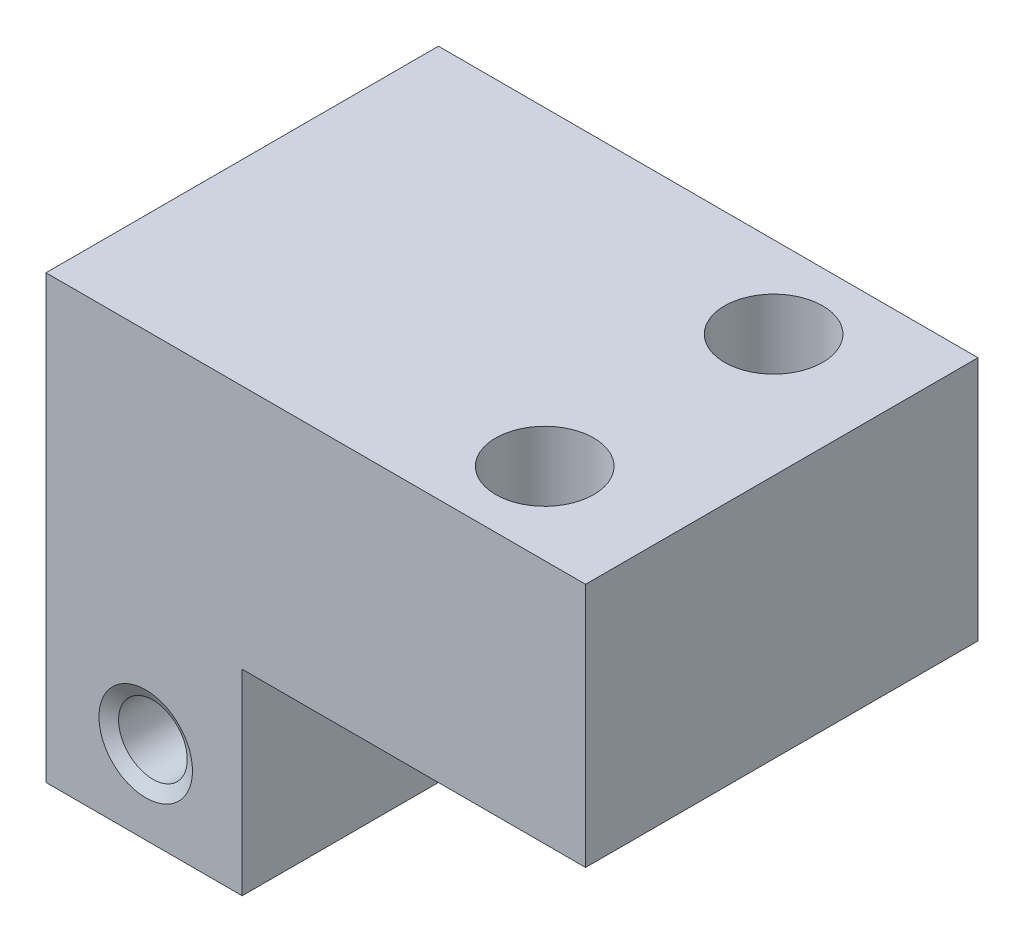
ISO-10303-21;
HEADER;
FILE_DESCRIPTION(('STEP AP214'),'2;1');
FILE_NAME('part.step','',(''),(''),'','','');
FILE_SCHEMA(('AUTOMOTIVE_DESIGN { 1 0 10303 214 1 1 1 1 }'));
ENDSEC;
DATA;
#1=APPLICATION_CONTEXT('core data for automotive mechanical design processes');
#2=APPLICATION_PROTOCOL_DEFINITION('international standard','automotive_design',2000,#1);
#3=PRODUCT_CONTEXT('',#1,'mechanical');
#4=PRODUCT('Part','Part','',(#3));
#5=PRODUCT_RELATED_PRODUCT_CATEGORY('part','',(#4));
#6=PRODUCT_DEFINITION_FORMATION('','',#4);
#7=PRODUCT_DEFINITION_CONTEXT('part definition',#1,'design');
#8=PRODUCT_DEFINITION('design','',#6,#7);
#9=PRODUCT_DEFINITION_SHAPE('','',#8);
#10=(LENGTH_UNIT() NAMED_UNIT(*) SI_UNIT(.MILLI.,.METRE.));
#11=(NAMED_UNIT(*) PLANE_ANGLE_UNIT() SI_UNIT($,.RADIAN.));
#12=(NAMED_UNIT(*) SI_UNIT($,.STERADIAN.) SOLID_ANGLE_UNIT());
#13=UNCERTAINTY_MEASURE_WITH_UNIT(LENGTH_MEASURE(1.E-05),#10,'distance_accuracy_value','');
#14=(GEOMETRIC_REPRESENTATION_CONTEXT(3) GLOBAL_UNCERTAINTY_ASSIGNED_CONTEXT((#13)) GLOBAL_UNIT_ASSIGNED_CONTEXT((#10,
#11,#12)) REPRESENTATION_CONTEXT('',''));
#15=CARTESIAN_POINT('',(0.,0.,0.));
#16=DIRECTION('',(0.,0.,1.));
#17=DIRECTION('',(1.,0.,0.));
#18=AXIS2_PLACEMENT_3D('',#15,#16,#17);
#19=CARTESIAN_POINT('',(-13.9,-6.9,-19.800000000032));
#20=DIRECTION('',(0.,0.,1.));
#21=DIRECTION('',(1.,0.,0.));
#22=AXIS2_PLACEMENT_3D('',#19,#20,#21);
#23=CONICAL_SURFACE('',#22,2.0999999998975,1.02974425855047);
#24=CARTESIAN_POINT('',(-13.9,-6.90000000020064,-21.0618072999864));
#25=VERTEX_POINT('',#24);
#26=VERTEX_LOOP('',#25);
#27=FACE_BOUND('',#26,.T.);
#28=CARTESIAN_POINT('',(-13.9,-6.9,-19.8));
#29=DIRECTION('',(0.,0.,1.));
#30=DIRECTION('',(0.,-1.,0.));
#31=AXIS2_PLACEMENT_3D('',#28,#29,#30);
#32=CIRCLE('',#31,2.1);
#33=CARTESIAN_POINT('',(-13.9,-9.,-19.8));
#34=VERTEX_POINT('',#33);
#35=EDGE_CURVE('E78',#34,#34,#32,.T.);
#36=ORIENTED_EDGE('',*,*,#35,.T.);
#37=EDGE_LOOP('',(#36));
#38=FACE_BOUND('',#37,.T.);
#39=ADVANCED_FACE('F16',(#27,#38),#23,.F.);
#40=CARTESIAN_POINT('',(-13.9,-6.9,-5.));
#41=DIRECTION('',(0.,0.,1.));
#42=DIRECTION('',(0.,-1.,0.));
#43=AXIS2_PLACEMENT_3D('',#40,#41,#42);
#44=CYLINDRICAL_SURFACE('',#43,2.1);
#45=ORIENTED_EDGE('',*,*,#35,.F.);
#46=EDGE_LOOP('',(#45));
#47=FACE_BOUND('',#46,.T.);
#48=CARTESIAN_POINT('',(-13.9,-6.9,-5.43878620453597));
#49=DIRECTION('',(0.,0.,1.));
#50=DIRECTION('',(1.,0.,0.));
#51=AXIS2_PLACEMENT_3D('',#48,#49,#50);
#52=CIRCLE('',#51,2.10000000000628);
#53=CARTESIAN_POINT('',(-11.7999999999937,-6.9,-5.43878620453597));
#54=VERTEX_POINT('',#53);
#55=EDGE_CURVE('E80',#54,#54,#52,.T.);
#56=ORIENTED_EDGE('',*,*,#55,.T.);
#57=EDGE_LOOP('',(#56));
#58=FACE_BOUND('',#57,.T.);
#59=ADVANCED_FACE('F75',(#47,#58),#44,.F.);
#60=CARTESIAN_POINT('',(-13.9,-6.9,-4.99999999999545));
#61=DIRECTION('',(0.,0.,1.));
#62=DIRECTION('',(1.,0.,0.));
#63=AXIS2_PLACEMENT_3D('',#60,#61,#62);
#64=CONICAL_SURFACE('',#63,2.85999999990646,1.0471975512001);
#65=CARTESIAN_POINT('',(-13.9,-6.9,-4.99999999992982));
#66=DIRECTION('',(0.,0.,1.));
#67=DIRECTION('',(1.,0.,0.));
#68=AXIS2_PLACEMENT_3D('',#65,#66,#67);
#69=CIRCLE('',#68,2.86000000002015);
#70=CARTESIAN_POINT('',(-11.0399999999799,-6.9,-4.99999999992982));
#71=VERTEX_POINT('',#70);
#72=EDGE_CURVE('E95',#71,#71,#69,.T.);
#73=ORIENTED_EDGE('',*,*,#72,.T.);
#74=EDGE_LOOP('',(#73));
#75=FACE_BOUND('',#74,.T.);
#76=ORIENTED_EDGE('',*,*,#55,.F.);
#77=EDGE_LOOP('',(#76));
#78=FACE_BOUND('',#77,.T.);
#79=ADVANCED_FACE('F192',(#75,#78),#64,.F.);
#80=CARTESIAN_POINT('',(13.,-12.,-35.));
#81=DIRECTION('',(0.,1.,0.));
#82=DIRECTION('',(0.,0.,1.));
#83=AXIS2_PLACEMENT_3D('',#80,#81,#82);
#84=PLANE('',#83);
#85=DIRECTION('',(1.,0.,0.));
#86=VECTOR('',#85,1.);
#87=CARTESIAN_POINT('',(13.,-12.,-5.));
#88=LINE('',#87,#86);
#89=CARTESIAN_POINT('',(-8.,-12.,-5.));
#90=VERTEX_POINT('',#89);
#91=CARTESIAN_POINT('',(-20.,-12.,-5.));
#92=VERTEX_POINT('',#91);
#93=EDGE_CURVE('E119',#90,#92,#88,.F.);
#94=ORIENTED_EDGE('',*,*,#93,.T.);
#95=DIRECTION('',(0.,0.,1.));
#96=VECTOR('',#95,1.);
#97=CARTESIAN_POINT('',(-20.,-12.,0.));
#98=LINE('',#97,#96);
#99=CARTESIAN_POINT('',(-20.,-12.,-28.9999999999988));
#100=VERTEX_POINT('',#99);
#101=EDGE_CURVE('E122',#100,#92,#98,.T.);
#102=ORIENTED_EDGE('',*,*,#101,.F.);
#103=DIRECTION('',(1.,0.,0.));
#104=VECTOR('',#103,1.);
#105=CARTESIAN_POINT('',(13.,-12.,-28.9999999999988));
#106=LINE('',#105,#104);
#107=CARTESIAN_POINT('',(-8.,-12.,-28.9999999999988));
#108=VERTEX_POINT('',#107);
#109=EDGE_CURVE('E127',#100,#108,#106,.T.);
#110=ORIENTED_EDGE('',*,*,#109,.T.);
#111=DIRECTION('',(0.,0.,1.));
#112=VECTOR('',#111,1.);
#113=CARTESIAN_POINT('',(-8.,-12.,-2.59759999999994));
#114=LINE('',#113,#112);
#115=EDGE_CURVE('E83',#108,#90,#114,.T.);
#116=ORIENTED_EDGE('',*,*,#115,.T.);
#117=EDGE_LOOP('',(#94,#102,#110,#116));
#118=FACE_BOUND('',#117,.T.);
#119=ADVANCED_FACE('F189',(#118),#84,.F.);
#120=CARTESIAN_POINT('',(-8.,0.,-2.59759999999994));
#121=DIRECTION('',(-1.,0.,0.));
#122=DIRECTION('',(0.,-1.,0.));
#123=AXIS2_PLACEMENT_3D('',#120,#121,#122);
#124=PLANE('',#123);
#125=DIRECTION('',(0.,1.,0.));
#126=VECTOR('',#125,1.);
#127=CARTESIAN_POINT('',(-8.,15.,-28.9999999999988));
#128=LINE('',#127,#126);
#129=CARTESIAN_POINT('',(-8.,0.,-28.9999999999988));
#130=VERTEX_POINT('',#129);
#131=EDGE_CURVE('E130',#108,#130,#128,.T.);
#132=ORIENTED_EDGE('',*,*,#131,.T.);
#133=DIRECTION('',(0.,0.,1.));
#134=VECTOR('',#133,1.);
#135=CARTESIAN_POINT('',(-8.,0.,-2.5976));
#136=LINE('',#135,#134);
#137=CARTESIAN_POINT('',(-8.,0.,-5.));
#138=VERTEX_POINT('',#137);
#139=EDGE_CURVE('E104',#130,#138,#136,.T.);
#140=ORIENTED_EDGE('',*,*,#139,.T.);
#141=DIRECTION('',(0.,1.,0.));
#142=VECTOR('',#141,1.);
#143=CARTESIAN_POINT('',(-8.,15.,-5.));
#144=LINE('',#143,#142);
#145=EDGE_CURVE('E117',#138,#90,#144,.F.);
#146=ORIENTED_EDGE('',*,*,#145,.T.);
#147=ORIENTED_EDGE('',*,*,#115,.F.);
#148=EDGE_LOOP('',(#132,#140,#146,#147));
#149=FACE_BOUND('',#148,.T.);
#150=ADVANCED_FACE('F186',(#149),#124,.F.);
#151=CARTESIAN_POINT('',(17.,0.,-2.5976));
#152=DIRECTION('',(0.,1.,0.));
#153=DIRECTION('',(-1.,0.,0.));
#154=AXIS2_PLACEMENT_3D('',#151,#152,#153);
#155=PLANE('',#154);
#156=DIRECTION('',(1.,0.,0.));
#157=VECTOR('',#156,1.);
#158=CARTESIAN_POINT('',(13.,0.,-5.));
#159=LINE('',#158,#157);
#160=CARTESIAN_POINT('',(13.,0.,-5.));
#161=VERTEX_POINT('',#160);
#162=EDGE_CURVE('E115',#161,#138,#159,.F.);
#163=ORIENTED_EDGE('',*,*,#162,.T.);
#164=ORIENTED_EDGE('',*,*,#139,.F.);
#165=DIRECTION('',(1.,0.,0.));
#166=VECTOR('',#165,1.);
#167=CARTESIAN_POINT('',(13.,0.,-28.9999999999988));
#168=LINE('',#167,#166);
#169=CARTESIAN_POINT('',(13.,0.,-28.9999999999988));
#170=VERTEX_POINT('',#169);
#171=EDGE_CURVE('E132',#130,#170,#168,.T.);
#172=ORIENTED_EDGE('',*,*,#171,.T.);
#173=DIRECTION('',(0.,0.,1.));
#174=VECTOR('',#173,1.);
#175=CARTESIAN_POINT('',(13.,0.,0.));
#176=LINE('',#175,#174);
#177=EDGE_CURVE('E69',#170,#161,#176,.T.);
#178=ORIENTED_EDGE('',*,*,#177,.T.);
#179=EDGE_LOOP('',(#163,#164,#172,#178));
#180=FACE_BOUND('',#179,.T.);
#181=CARTESIAN_POINT('',(5.50000000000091,0.,-23.9999999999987));
#182=DIRECTION('',(0.,-1.,0.));
#183=DIRECTION('',(1.,0.,0.));
#184=AXIS2_PLACEMENT_3D('',#181,#182,#183);
#185=CIRCLE('',#184,3.);
#186=CARTESIAN_POINT('',(8.50000000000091,0.,-23.9999999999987));
#187=VERTEX_POINT('',#186);
#188=EDGE_CURVE('E98',#187,#187,#185,.F.);
#189=ORIENTED_EDGE('',*,*,#188,.T.);
#190=EDGE_LOOP('',(#189));
#191=FACE_BOUND('',#190,.T.);
#192=CARTESIAN_POINT('',(5.50000000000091,0.,-10.));
#193=DIRECTION('',(0.,-1.,0.));
#194=DIRECTION('',(1.,0.,0.));
#195=AXIS2_PLACEMENT_3D('',#192,#193,#194);
#196=CIRCLE('',#195,3.);
#197=CARTESIAN_POINT('',(8.50000000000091,0.,-10.));
#198=VERTEX_POINT('',#197);
#199=EDGE_CURVE('E19',#198,#198,#196,.F.);
#200=ORIENTED_EDGE('',*,*,#199,.T.);
#201=EDGE_LOOP('',(#200));
#202=FACE_BOUND('',#201,.T.);
#203=ADVANCED_FACE('F182',(#180,#191,#202),#155,.F.);
#204=CARTESIAN_POINT('',(5.50000000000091,0.,-10.));
#205=DIRECTION('',(0.,-1.,0.));
#206=DIRECTION('',(1.,0.,0.));
#207=AXIS2_PLACEMENT_3D('',#204,#205,#206);
#208=CYLINDRICAL_SURFACE('',#207,3.);
#209=CARTESIAN_POINT('',(5.5000000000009,15.,-10.));
#210=DIRECTION('',(0.,-1.,0.));
#211=DIRECTION('',(1.,0.,0.));
#212=AXIS2_PLACEMENT_3D('',#209,#210,#211);
#213=CIRCLE('',#212,3.);
#214=CARTESIAN_POINT('',(8.5000000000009,15.,-10.));
#215=VERTEX_POINT('',#214);
#216=EDGE_CURVE('E91',#215,#215,#213,.F.);
#217=ORIENTED_EDGE('',*,*,#216,.T.);
#218=EDGE_LOOP('',(#217));
#219=FACE_BOUND('',#218,.T.);
#220=ORIENTED_EDGE('',*,*,#199,.F.);
#221=EDGE_LOOP('',(#220));
#222=FACE_BOUND('',#221,.T.);
#223=ADVANCED_FACE('F178',(#219,#222),#208,.F.);
#224=CARTESIAN_POINT('',(5.50000000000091,0.,-23.9999999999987));
#225=DIRECTION('',(0.,-1.,0.));
#226=DIRECTION('',(1.,0.,0.));
#227=AXIS2_PLACEMENT_3D('',#224,#225,#226);
#228=CYLINDRICAL_SURFACE('',#227,3.);
#229=CARTESIAN_POINT('',(5.5000000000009,15.,-23.9999999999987));
#230=DIRECTION('',(0.,-1.,0.));
#231=DIRECTION('',(1.,0.,0.));
#232=AXIS2_PLACEMENT_3D('',#229,#230,#231);
#233=CIRCLE('',#232,3.);
#234=CARTESIAN_POINT('',(8.5000000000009,15.,-23.9999999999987));
#235=VERTEX_POINT('',#234);
#236=EDGE_CURVE('E87',#235,#235,#233,.F.);
#237=ORIENTED_EDGE('',*,*,#236,.T.);
#238=EDGE_LOOP('',(#237));
#239=FACE_BOUND('',#238,.T.);
#240=ORIENTED_EDGE('',*,*,#188,.F.);
#241=EDGE_LOOP('',(#240));
#242=FACE_BOUND('',#241,.T.);
#243=ADVANCED_FACE('F175',(#239,#242),#228,.F.);
#244=CARTESIAN_POINT('',(13.,0.,0.));
#245=DIRECTION('',(-1.,0.,0.));
#246=DIRECTION('',(0.,0.,1.));
#247=AXIS2_PLACEMENT_3D('',#244,#245,#246);
#248=PLANE('',#247);
#249=ORIENTED_EDGE('',*,*,#177,.F.);
#250=DIRECTION('',(0.,1.,0.));
#251=VECTOR('',#250,1.);
#252=CARTESIAN_POINT('',(13.,15.,-28.9999999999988));
#253=LINE('',#252,#251);
#254=CARTESIAN_POINT('',(13.,15.,-28.9999999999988));
#255=VERTEX_POINT('',#254);
#256=EDGE_CURVE('E94',#170,#255,#253,.T.);
#257=ORIENTED_EDGE('',*,*,#256,.T.);
#258=DIRECTION('',(0.,0.,-1.));
#259=VECTOR('',#258,1.);
#260=CARTESIAN_POINT('',(13.,15.,-10.4999999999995));
#261=LINE('',#260,#259);
#262=CARTESIAN_POINT('',(13.,15.,-5.));
#263=VERTEX_POINT('',#262);
#264=EDGE_CURVE('E90',#255,#263,#261,.F.);
#265=ORIENTED_EDGE('',*,*,#264,.T.);
#266=DIRECTION('',(0.,1.,0.));
#267=VECTOR('',#266,1.);
#268=CARTESIAN_POINT('',(13.,15.,-5.));
#269=LINE('',#268,#267);
#270=EDGE_CURVE('E97',#263,#161,#269,.F.);
#271=ORIENTED_EDGE('',*,*,#270,.T.);
#272=EDGE_LOOP('',(#249,#257,#265,#271));
#273=FACE_BOUND('',#272,.T.);
#274=ADVANCED_FACE('F155',(#273),#248,.F.);
#275=CARTESIAN_POINT('',(13.,15.,-5.));
#276=DIRECTION('',(0.,0.,-1.));
#277=DIRECTION('',(0.,1.,0.));
#278=AXIS2_PLACEMENT_3D('',#275,#276,#277);
#279=PLANE('',#278);
#280=DIRECTION('',(0.,1.,0.));
#281=VECTOR('',#280,1.);
#282=CARTESIAN_POINT('',(-20.,0.,-5.));
#283=LINE('',#282,#281);
#284=CARTESIAN_POINT('',(-20.,15.,-5.));
#285=VERTEX_POINT('',#284);
#286=EDGE_CURVE('E124',#92,#285,#283,.T.);
#287=ORIENTED_EDGE('',*,*,#286,.F.);
#288=ORIENTED_EDGE('',*,*,#93,.F.);
#289=ORIENTED_EDGE('',*,*,#145,.F.);
#290=ORIENTED_EDGE('',*,*,#162,.F.);
#291=ORIENTED_EDGE('',*,*,#270,.F.);
#292=DIRECTION('',(1.,0.,0.));
#293=VECTOR('',#292,1.);
#294=CARTESIAN_POINT('',(13.,15.,-5.));
#295=LINE('',#294,#293);
#296=EDGE_CURVE('E138',#263,#285,#295,.F.);
#297=ORIENTED_EDGE('',*,*,#296,.T.);
#298=EDGE_LOOP('',(#287,#288,#289,#290,#291,#297));
#299=FACE_BOUND('',#298,.T.);
#300=ORIENTED_EDGE('',*,*,#72,.F.);
#301=EDGE_LOOP('',(#300));
#302=FACE_BOUND('',#301,.T.);
#303=ADVANCED_FACE('F151',(#299,#302),#279,.F.);
#304=CARTESIAN_POINT('',(-20.,0.,0.));
#305=DIRECTION('',(-1.,0.,0.));
#306=DIRECTION('',(0.,0.,1.));
#307=AXIS2_PLACEMENT_3D('',#304,#305,#306);
#308=PLANE('',#307);
#309=ORIENTED_EDGE('',*,*,#286,.T.);
#310=DIRECTION('',(0.,0.,-1.));
#311=VECTOR('',#310,1.);
#312=CARTESIAN_POINT('',(-20.,15.,-10.4999999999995));
#313=LINE('',#312,#311);
#314=CARTESIAN_POINT('',(-20.,15.,-28.9999999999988));
#315=VERTEX_POINT('',#314);
#316=EDGE_CURVE('E25',#285,#315,#313,.T.);
#317=ORIENTED_EDGE('',*,*,#316,.T.);
#318=DIRECTION('',(0.,1.,0.));
#319=VECTOR('',#318,1.);
#320=CARTESIAN_POINT('',(-20.,15.,-28.9999999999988));
#321=LINE('',#320,#319);
#322=EDGE_CURVE('E33',#315,#100,#321,.F.);
#323=ORIENTED_EDGE('',*,*,#322,.T.);
#324=ORIENTED_EDGE('',*,*,#101,.T.);
#325=EDGE_LOOP('',(#309,#317,#323,#324));
#326=FACE_BOUND('',#325,.T.);
#327=ADVANCED_FACE('F144',(#326),#308,.T.);
#328=CARTESIAN_POINT('',(13.,15.,-28.9999999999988));
#329=DIRECTION('',(0.,0.,1.));
#330=DIRECTION('',(1.,0.,0.));
#331=AXIS2_PLACEMENT_3D('',#328,#329,#330);
#332=PLANE('',#331);
#333=ORIENTED_EDGE('',*,*,#171,.F.);
#334=ORIENTED_EDGE('',*,*,#131,.F.);
#335=ORIENTED_EDGE('',*,*,#109,.F.);
#336=ORIENTED_EDGE('',*,*,#322,.F.);
#337=DIRECTION('',(1.,0.,0.));
#338=VECTOR('',#337,1.);
#339=CARTESIAN_POINT('',(13.,15.,-28.9999999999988));
#340=LINE('',#339,#338);
#341=EDGE_CURVE('E11',#315,#255,#340,.T.);
#342=ORIENTED_EDGE('',*,*,#341,.T.);
#343=ORIENTED_EDGE('',*,*,#256,.F.);
#344=EDGE_LOOP('',(#333,#334,#335,#336,#342,#343));
#345=FACE_BOUND('',#344,.T.);
#346=ADVANCED_FACE('F158',(#345),#332,.F.);
#347=CARTESIAN_POINT('',(13.,15.,-10.4999999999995));
#348=DIRECTION('',(0.,-1.,0.));
#349=DIRECTION('',(0.,0.,-1.));
#350=AXIS2_PLACEMENT_3D('',#347,#348,#349);
#351=PLANE('',#350);
#352=ORIENTED_EDGE('',*,*,#316,.F.);
#353=ORIENTED_EDGE('',*,*,#296,.F.);
#354=ORIENTED_EDGE('',*,*,#264,.F.);
#355=ORIENTED_EDGE('',*,*,#341,.F.);
#356=EDGE_LOOP('',(#352,#353,#354,#355));
#357=FACE_BOUND('',#356,.T.);
#358=ORIENTED_EDGE('',*,*,#236,.F.);
#359=EDGE_LOOP('',(#358));
#360=FACE_BOUND('',#359,.T.);
#361=ORIENTED_EDGE('',*,*,#216,.F.);
#362=EDGE_LOOP('',(#361));
#363=FACE_BOUND('',#362,.T.);
#364=ADVANCED_FACE('F148',(#357,#360,#363),#351,.F.);
#365=CLOSED_SHELL('',(#39,#59,#79,#119,#150,#203,#223,#243,#274,#303,#327,#346,#364));
#366=MANIFOLD_SOLID_BREP('B1',#365);
#367=ADVANCED_BREP_SHAPE_REPRESENTATION('',(#18,#366),#14);
#368=SHAPE_DEFINITION_REPRESENTATION(#9,#367);
ENDSEC;
END-ISO-10303-21;
